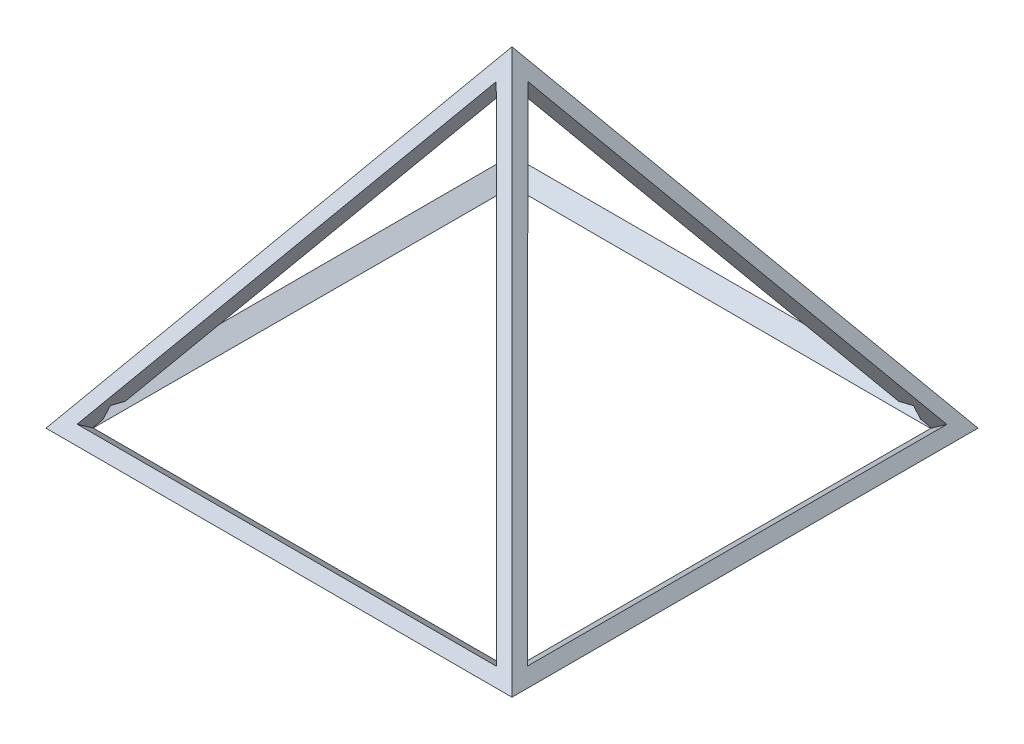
ISO-10303-21;
HEADER;
FILE_DESCRIPTION(('STEP AP214'),'2;1');
FILE_NAME('part.step','',(''),(''),'','','');
FILE_SCHEMA(('AUTOMOTIVE_DESIGN { 1 0 10303 214 1 1 1 1 }'));
ENDSEC;
DATA;
#1=APPLICATION_CONTEXT('core data for automotive mechanical design processes');
#2=APPLICATION_PROTOCOL_DEFINITION('international standard','automotive_design',2000,#1);
#3=PRODUCT_CONTEXT('',#1,'mechanical');
#4=PRODUCT('Part','Part','',(#3));
#5=PRODUCT_RELATED_PRODUCT_CATEGORY('part','',(#4));
#6=PRODUCT_DEFINITION_FORMATION('','',#4);
#7=PRODUCT_DEFINITION_CONTEXT('part definition',#1,'design');
#8=PRODUCT_DEFINITION('design','',#6,#7);
#9=PRODUCT_DEFINITION_SHAPE('','',#8);
#10=(LENGTH_UNIT() NAMED_UNIT(*) SI_UNIT(.MILLI.,.METRE.));
#11=(NAMED_UNIT(*) PLANE_ANGLE_UNIT() SI_UNIT($,.RADIAN.));
#12=(NAMED_UNIT(*) SI_UNIT($,.STERADIAN.) SOLID_ANGLE_UNIT());
#13=UNCERTAINTY_MEASURE_WITH_UNIT(LENGTH_MEASURE(1.E-05),#10,'distance_accuracy_value','');
#14=(GEOMETRIC_REPRESENTATION_CONTEXT(3) GLOBAL_UNCERTAINTY_ASSIGNED_CONTEXT((#13)) GLOBAL_UNIT_ASSIGNED_CONTEXT((#10,
#11,#12)) REPRESENTATION_CONTEXT('',''));
#15=CARTESIAN_POINT('',(0.,0.,0.));
#16=DIRECTION('',(0.,0.,1.));
#17=DIRECTION('',(1.,0.,0.));
#18=AXIS2_PLACEMENT_3D('',#15,#16,#17);
#19=CARTESIAN_POINT('',(37.6966543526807,-0.204417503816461,-37.9928324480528));
#20=DIRECTION('',(-0.287871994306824,0.408084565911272,-0.866369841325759));
#21=DIRECTION('',(0.,0.904665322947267,0.426122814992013));
#22=AXIS2_PLACEMENT_3D('',#19,#20,#21);
#23=PLANE('',#22);
#24=DIRECTION('',(0.948984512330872,0.,-0.31532268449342));
#25=VECTOR('',#24,1.);
#26=CARTESIAN_POINT('',(38.0073642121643,2.,-37.0577305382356));
#27=LINE('',#26,#25);
#28=CARTESIAN_POINT('',(36.6123738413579,2.,-36.5942117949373));
#29=VERTEX_POINT('',#28);
#30=CARTESIAN_POINT('',(37.5524536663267,2.,-36.9065756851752));
#31=VERTEX_POINT('',#30);
#32=EDGE_CURVE('E347',#29,#31,#27,.T.);
#33=ORIENTED_EDGE('',*,*,#32,.T.);
#34=DIRECTION('',(0.,-0.904665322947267,-0.426122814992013));
#35=VECTOR('',#34,1.);
#36=CARTESIAN_POINT('',(37.5524536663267,-0.22288832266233,-37.9536186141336));
#37=LINE('',#36,#35);
#38=CARTESIAN_POINT('',(37.5524536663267,0.672111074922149,-37.5320487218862));
#39=VERTEX_POINT('',#38);
#40=EDGE_CURVE('E373',#31,#39,#37,.T.);
#41=ORIENTED_EDGE('',*,*,#40,.T.);
#42=DIRECTION('',(0.500596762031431,-0.707106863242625,-0.499402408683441));
#43=VECTOR('',#42,1.);
#44=CARTESIAN_POINT('',(38.0140550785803,0.0200862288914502,-37.9925488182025));
#45=LINE('',#44,#43);
#46=CARTESIAN_POINT('',(38.0071589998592,0.0298271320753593,-37.9856691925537));
#47=VERTEX_POINT('',#46);
#48=EDGE_CURVE('E580',#39,#47,#45,.T.);
#49=ORIENTED_EDGE('',*,*,#48,.T.);
#50=DIRECTION('',(-0.956410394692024,-0.168871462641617,0.238246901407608));
#51=VECTOR('',#50,1.);
#52=CARTESIAN_POINT('',(37.6869332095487,-0.0267144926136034,-37.9058992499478));
#53=LINE('',#52,#51);
#54=CARTESIAN_POINT('',(37.8382318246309,0.,-37.9435885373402));
#55=VERTEX_POINT('',#54);
#56=EDGE_CURVE('E499',#47,#55,#53,.T.);
#57=ORIENTED_EDGE('',*,*,#56,.T.);
#58=DIRECTION('',(0.948984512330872,0.,-0.31532268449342));
#59=VECTOR('',#58,1.);
#60=CARTESIAN_POINT('',(-7.59190603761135,0.,-22.848344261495));
#61=LINE('',#60,#59);
#62=CARTESIAN_POINT('',(37.9864346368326,0.,-37.9928324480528));
#63=VERTEX_POINT('',#62);
#64=EDGE_CURVE('E496',#55,#63,#61,.T.);
#65=ORIENTED_EDGE('',*,*,#64,.T.);
#66=DIRECTION('',(0.817144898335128,0.576432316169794,0.));
#67=VECTOR('',#66,1.);
#68=CARTESIAN_POINT('',(37.6966543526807,-0.204417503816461,-37.9928324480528));
#69=LINE('',#68,#67);
#70=CARTESIAN_POINT('',(39.3309441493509,0.948447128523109,-37.9928324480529));
#71=VERTEX_POINT('',#70);
#72=EDGE_CURVE('E498',#63,#71,#69,.T.);
#73=ORIENTED_EDGE('',*,*,#72,.T.);
#74=DIRECTION('',(-0.499403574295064,0.707949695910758,0.499402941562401));
#75=VECTOR('',#74,1.);
#76=CARTESIAN_POINT('',(39.3309441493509,0.948447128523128,-37.9928324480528));
#77=LINE('',#76,#75);
#78=CARTESIAN_POINT('',(21.3524154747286,26.4346361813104,-20.0143265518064));
#79=VERTEX_POINT('',#78);
#80=EDGE_CURVE('E508',#71,#79,#77,.T.);
#81=ORIENTED_EDGE('',*,*,#80,.T.);
#82=DIRECTION('',(0.817144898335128,0.576432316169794,0.));
#83=VECTOR('',#82,1.);
#84=CARTESIAN_POINT('',(19.7181256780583,25.2817715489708,-20.0143265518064));
#85=LINE('',#84,#83);
#86=CARTESIAN_POINT('',(19.9928367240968,25.4755588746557,-20.0143265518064));
#87=VERTEX_POINT('',#86);
#88=EDGE_CURVE('E514',#87,#79,#85,.T.);
#89=ORIENTED_EDGE('',*,*,#88,.F.);
#90=CARTESIAN_POINT('',(19.9999893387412,25.465455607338,-20.0214621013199));
#91=VERTEX_POINT('',#90);
#92=EDGE_CURVE('E389',#87,#91,#45,.T.);
#93=ORIENTED_EDGE('',*,*,#92,.T.);
#94=DIRECTION('',(-0.316755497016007,-0.89432071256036,-0.31600066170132));
#95=VECTOR('',#94,1.);
#96=CARTESIAN_POINT('',(19.9218911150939,25.2449547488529,-20.0993742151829));
#97=LINE('',#96,#95);
#98=CARTESIAN_POINT('',(20.,25.4654857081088,-20.0214514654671));
#99=VERTEX_POINT('',#98);
#100=EDGE_CURVE('E500',#99,#91,#97,.T.);
#101=ORIENTED_EDGE('',*,*,#100,.F.);
#102=DIRECTION('',(-0.239730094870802,0.845154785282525,0.477747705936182));
#103=VECTOR('',#102,1.);
#104=CARTESIAN_POINT('',(24.2049253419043,10.6412610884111,-28.4012647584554));
#105=LINE('',#104,#103);
#106=CARTESIAN_POINT('',(20.0000213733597,25.4654103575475,-20.0214940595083));
#107=VERTEX_POINT('',#106);
#108=EDGE_CURVE('E503',#107,#99,#105,.T.);
#109=ORIENTED_EDGE('',*,*,#108,.F.);
#110=EDGE_CURVE('E581',#107,#29,#45,.T.);
#111=ORIENTED_EDGE('',*,*,#110,.T.);
#112=EDGE_LOOP('',(#33,#41,#49,#57,#65,#73,#81,#89,#93,#101,#109,#111));
#113=FACE_BOUND('',#112,.T.);
#114=ADVANCED_FACE('F35',(#113),#23,.F.);
#115=CARTESIAN_POINT('',(19.7181256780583,25.2817715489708,-20.0143265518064));
#116=DIRECTION('',(-0.288560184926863,0.409060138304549,0.865680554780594));
#117=DIRECTION('',(0.,-0.904141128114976,0.427233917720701));
#118=AXIS2_PLACEMENT_3D('',#115,#116,#117);
#119=PLANE('',#118);
#120=DIRECTION('',(0.499999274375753,-0.706685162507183,0.500596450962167));
#121=VECTOR('',#120,1.);
#122=CARTESIAN_POINT('',(37.9996651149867,0.0328073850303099,-1.989583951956));
#123=LINE('',#122,#121);
#124=CARTESIAN_POINT('',(37.5422490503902,0.679306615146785,-2.44754633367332));
#125=VERTEX_POINT('',#124);
#126=CARTESIAN_POINT('',(37.9964119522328,0.0374053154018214,-1.99284100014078));
#127=VERTEX_POINT('',#126);
#128=EDGE_CURVE('E423',#125,#127,#123,.T.);
#129=ORIENTED_EDGE('',*,*,#128,.F.);
#130=DIRECTION('',(0.817144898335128,0.576432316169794,0.));
#131=VECTOR('',#130,1.);
#132=CARTESIAN_POINT('',(37.2290900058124,0.458397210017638,-2.44754633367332));
#133=LINE('',#132,#131);
#134=CARTESIAN_POINT('',(37.5524536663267,0.686505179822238,-2.44754633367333));
#135=VERTEX_POINT('',#134);
#136=EDGE_CURVE('E386',#125,#135,#133,.T.);
#137=ORIENTED_EDGE('',*,*,#136,.T.);
#138=DIRECTION('',(0.,0.904141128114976,-0.427233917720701));
#139=VECTOR('',#138,1.);
#140=CARTESIAN_POINT('',(37.5524536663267,27.5781181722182,-15.1546435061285));
#141=LINE('',#140,#139);
#142=CARTESIAN_POINT('',(37.5524536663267,2.,-3.06821220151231));
#143=VERTEX_POINT('',#142);
#144=EDGE_CURVE('E376',#135,#143,#141,.T.);
#145=ORIENTED_EDGE('',*,*,#144,.T.);
#146=DIRECTION('',(-0.948683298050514,0.,-0.316227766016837));
#147=VECTOR('',#146,1.);
#148=CARTESIAN_POINT('',(16.417724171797,2.,-10.1131220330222));
#149=LINE('',#148,#147);
#150=CARTESIAN_POINT('',(36.6078219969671,2.,-3.38308942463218));
#151=VERTEX_POINT('',#150);
#152=EDGE_CURVE('E367',#143,#151,#149,.T.);
#153=ORIENTED_EDGE('',*,*,#152,.T.);
#154=CARTESIAN_POINT('',(20.0428941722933,25.4124114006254,-19.9678016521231));
#155=VERTEX_POINT('',#154);
#156=EDGE_CURVE('E419',#155,#151,#123,.T.);
#157=ORIENTED_EDGE('',*,*,#156,.F.);
#158=DIRECTION('',(0.00204085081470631,0.904401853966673,-0.426676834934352));
#159=VECTOR('',#158,1.);
#160=CARTESIAN_POINT('',(20.0426922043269,25.3229094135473,-19.9255765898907));
#161=LINE('',#160,#159);
#162=CARTESIAN_POINT('',(20.0429796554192,25.4502931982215,-19.9856734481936));
#163=VERTEX_POINT('',#162);
#164=EDGE_CURVE('E410',#155,#163,#161,.T.);
#165=ORIENTED_EDGE('',*,*,#164,.T.);
#166=DIRECTION('',(-0.948683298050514,0.,-0.316227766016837));
#167=VECTOR('',#166,1.);
#168=CARTESIAN_POINT('',(19.7420151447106,25.4502931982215,-20.0859949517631));
#169=LINE('',#168,#167);
#170=CARTESIAN_POINT('',(20.0160917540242,25.4502931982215,-19.9946360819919));
#171=VERTEX_POINT('',#170);
#172=EDGE_CURVE('E413',#163,#171,#169,.T.);
#173=ORIENTED_EDGE('',*,*,#172,.T.);
#174=CARTESIAN_POINT('',(20.,25.4730368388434,-20.0107470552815));
#175=VERTEX_POINT('',#174);
#176=EDGE_CURVE('E408',#175,#171,#123,.T.);
#177=ORIENTED_EDGE('',*,*,#176,.F.);
#178=DIRECTION('',(0.478351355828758,0.84480847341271,-0.239746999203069));
#179=VECTOR('',#178,1.);
#180=CARTESIAN_POINT('',(19.9538025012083,25.3914481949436,-19.9875931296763));
#181=LINE('',#180,#179);
#182=CARTESIAN_POINT('',(19.9957032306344,25.4654483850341,-20.0085935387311));
#183=VERTEX_POINT('',#182);
#184=EDGE_CURVE('E493',#183,#175,#181,.T.);
#185=ORIENTED_EDGE('',*,*,#184,.F.);
#186=DIRECTION('',(-0.239453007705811,0.844577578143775,-0.478906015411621));
#187=VECTOR('',#186,1.);
#188=CARTESIAN_POINT('',(20.0162763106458,25.3928848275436,-19.9674473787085));
#189=LINE('',#188,#187);
#190=EDGE_CURVE('E522',#183,#87,#189,.T.);
#191=ORIENTED_EDGE('',*,*,#190,.T.);
#192=ORIENTED_EDGE('',*,*,#88,.T.);
#193=DIRECTION('',(0.499006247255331,-0.707386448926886,0.5005968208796));
#194=VECTOR('',#193,1.);
#195=CARTESIAN_POINT('',(21.3524154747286,26.4346361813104,-20.0143265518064));
#196=LINE('',#195,#194);
#197=CARTESIAN_POINT('',(39.3166403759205,0.968724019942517,-1.99284100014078));
#198=VERTEX_POINT('',#197);
#199=EDGE_CURVE('E414',#79,#198,#196,.T.);
#200=ORIENTED_EDGE('',*,*,#199,.T.);
#201=DIRECTION('',(0.817144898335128,0.576432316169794,0.));
#202=VECTOR('',#201,1.);
#203=CARTESIAN_POINT('',(37.6823505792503,-0.184140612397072,-1.99284100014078));
#204=LINE('',#203,#202);
#205=EDGE_CURVE('E515',#127,#198,#204,.T.);
#206=ORIENTED_EDGE('',*,*,#205,.F.);
#207=EDGE_LOOP('',(#129,#137,#145,#153,#157,#165,#173,#177,#185,#191,#192,#200,#206));
#208=FACE_BOUND('',#207,.T.);
#209=ADVANCED_FACE('F684',(#208),#119,.F.);
#210=CARTESIAN_POINT('',(20.2818743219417,25.2817715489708,-19.9856734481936));
#211=DIRECTION('',(0.288560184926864,0.409060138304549,-0.865680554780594));
#212=DIRECTION('',(0.,0.904141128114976,0.427233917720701));
#213=AXIS2_PLACEMENT_3D('',#210,#211,#212);
#214=PLANE('',#213);
#215=DIRECTION('',(0.948683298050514,0.,0.316227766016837));
#216=VECTOR('',#215,1.);
#217=CARTESIAN_POINT('',(11.6078090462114,0.,-34.8234271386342));
#218=LINE('',#217,#216);
#219=CARTESIAN_POINT('',(2.05661346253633,0.,-38.0071589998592));
#220=VERTEX_POINT('',#219);
#221=CARTESIAN_POINT('',(2.11918840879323,0.,-37.9863006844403));
#222=VERTEX_POINT('',#221);
#223=EDGE_CURVE('E544',#220,#222,#218,.T.);
#224=ORIENTED_EDGE('',*,*,#223,.T.);
#225=DIRECTION('',(-0.956279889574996,0.168040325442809,-0.239355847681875));
#226=VECTOR('',#225,1.);
#227=CARTESIAN_POINT('',(18.7860084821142,-2.92874282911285,-33.8146132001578));
#228=LINE('',#227,#226);
#229=CARTESIAN_POINT('',(2.03585479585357,0.0146436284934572,-38.0071589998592));
#230=VERTEX_POINT('',#229);
#231=EDGE_CURVE('E547',#222,#230,#228,.T.);
#232=ORIENTED_EDGE('',*,*,#231,.T.);
#233=DIRECTION('',(-0.817144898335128,0.576432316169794,0.));
#234=VECTOR('',#233,1.);
#235=CARTESIAN_POINT('',(2.31764942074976,-0.184140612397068,-38.0071589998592));
#236=LINE('',#235,#234);
#237=EDGE_CURVE('E399',#220,#230,#236,.T.);
#238=ORIENTED_EDGE('',*,*,#237,.F.);
#239=EDGE_LOOP('',(#224,#232,#238));
#240=FACE_BOUND('',#239,.T.);
#241=ADVANCED_FACE('F660',(#240),#214,.F.);
#242=CARTESIAN_POINT('',(2.31764942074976,-0.184140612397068,-38.0071589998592));
#243=DIRECTION('',(-0.576432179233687,-0.817144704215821,-0.000689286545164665));
#244=DIRECTION('',(0.817144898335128,-0.576432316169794,0.));
#245=AXIS2_PLACEMENT_3D('',#242,#243,#244);
#246=PLANE('',#245);
#247=ORIENTED_EDGE('',*,*,#237,.T.);
#248=DIRECTION('',(0.631999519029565,-0.446361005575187,0.633512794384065));
#249=VECTOR('',#248,1.);
#250=CARTESIAN_POINT('',(2.20448718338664,-0.10445602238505,-37.8381228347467));
#251=LINE('',#250,#249);
#252=CARTESIAN_POINT('',(2.05658861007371,0.,-37.9863755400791));
#253=VERTEX_POINT('',#252);
#254=EDGE_CURVE('E395',#230,#253,#251,.T.);
#255=ORIENTED_EDGE('',*,*,#254,.T.);
#256=DIRECTION('',(0.0011957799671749,0.,-0.999999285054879));
#257=VECTOR('',#256,1.);
#258=CARTESIAN_POINT('',(2.01116235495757,0.,0.00240490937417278));
#259=LINE('',#258,#257);
#260=EDGE_CURVE('E398',#253,#220,#259,.T.);
#261=ORIENTED_EDGE('',*,*,#260,.T.);
#262=EDGE_LOOP('',(#247,#255,#261));
#263=FACE_BOUND('',#262,.T.);
#264=ADVANCED_FACE('F656',(#263),#246,.F.);
#265=CARTESIAN_POINT('',(1.99999999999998,-0.194281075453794,-2.31049611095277));
#266=DIRECTION('',(0.,-0.817144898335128,0.576432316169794));
#267=DIRECTION('',(0.,-0.576432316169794,-0.817144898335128));
#268=AXIS2_PLACEMENT_3D('',#265,#266,#267);
#269=PLANE('',#268);
#270=DIRECTION('',(0.,0.576432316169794,0.817144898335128));
#271=VECTOR('',#270,1.);
#272=CARTESIAN_POINT('',(1.99999999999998,-0.194281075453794,-2.31049611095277));
#273=LINE('',#272,#271);
#274=CARTESIAN_POINT('',(1.99999999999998,0.,-2.03508512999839));
#275=VERTEX_POINT('',#274);
#276=CARTESIAN_POINT('',(1.99999999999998,0.00958140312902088,-2.02150262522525));
#277=VERTEX_POINT('',#276);
#278=EDGE_CURVE('E465',#275,#277,#273,.T.);
#279=ORIENTED_EDGE('',*,*,#278,.T.);
#280=DIRECTION('',(0.633210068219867,-0.446147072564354,-0.632453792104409));
#281=VECTOR('',#280,1.);
#282=CARTESIAN_POINT('',(2.17332711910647,-0.112541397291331,-2.19462273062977));
#283=LINE('',#282,#281);
#284=CARTESIAN_POINT('',(2.01359874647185,0.,-2.03508512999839));
#285=VERTEX_POINT('',#284);
#286=EDGE_CURVE('E468',#277,#285,#283,.T.);
#287=ORIENTED_EDGE('',*,*,#286,.T.);
#288=DIRECTION('',(-1.,0.,0.));
#289=VECTOR('',#288,1.);
#290=CARTESIAN_POINT('',(0.,0.,-2.03508512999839));
#291=LINE('',#290,#289);
#292=EDGE_CURVE('E429',#285,#275,#291,.T.);
#293=ORIENTED_EDGE('',*,*,#292,.T.);
#294=EDGE_LOOP('',(#279,#287,#293));
#295=FACE_BOUND('',#294,.T.);
#296=ADVANCED_FACE('F733',(#295),#269,.F.);
#297=CARTESIAN_POINT('',(20.,25.2817755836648,-20.2818771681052));
#298=DIRECTION('',(-0.866025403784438,0.408572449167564,-0.288216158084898));
#299=DIRECTION('',(-0.426678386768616,-0.904403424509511,0.));
#300=AXIS2_PLACEMENT_3D('',#297,#298,#299);
#301=PLANE('',#300);
#302=DIRECTION('',(0.315775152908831,0.,-0.948834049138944));
#303=VECTOR('',#302,1.);
#304=CARTESIAN_POINT('',(1.19082352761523,0.,0.396310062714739));
#305=LINE('',#304,#303);
#306=CARTESIAN_POINT('',(2.01364778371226,0.,-2.07609368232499));
#307=VERTEX_POINT('',#306);
#308=EDGE_CURVE('E409',#275,#307,#305,.T.);
#309=ORIENTED_EDGE('',*,*,#308,.T.);
#310=DIRECTION('',(-0.239094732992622,0.167856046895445,0.956377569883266));
#311=VECTOR('',#310,1.);
#312=CARTESIAN_POINT('',(6.19023734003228,-2.93216752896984,-18.782428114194));
#313=LINE('',#312,#311);
#314=EDGE_CURVE('E405',#307,#277,#313,.T.);
#315=ORIENTED_EDGE('',*,*,#314,.T.);
#316=ORIENTED_EDGE('',*,*,#278,.F.);
#317=EDGE_LOOP('',(#309,#315,#316));
#318=FACE_BOUND('',#317,.T.);
#319=ADVANCED_FACE('F727',(#318),#301,.F.);
#320=CARTESIAN_POINT('',(38.,-0.194281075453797,-2.31049611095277));
#321=DIRECTION('',(0.866025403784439,0.408572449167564,-0.288216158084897));
#322=DIRECTION('',(-0.426678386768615,0.904403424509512,0.));
#323=AXIS2_PLACEMENT_3D('',#320,#321,#322);
#324=PLANE('',#323);
#325=DIRECTION('',(0.315775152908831,0.,0.948834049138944));
#326=VECTOR('',#325,1.);
#327=CARTESIAN_POINT('',(37.0680100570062,2.,-2.00032673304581));
#328=LINE('',#327,#326);
#329=CARTESIAN_POINT('',(36.9191738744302,2.,-2.44754633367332));
#330=VERTEX_POINT('',#329);
#331=EDGE_CURVE('E364',#151,#330,#328,.T.);
#332=ORIENTED_EDGE('',*,*,#331,.T.);
#333=DIRECTION('',(0.426678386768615,-0.904403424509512,0.));
#334=VECTOR('',#333,1.);
#335=CARTESIAN_POINT('',(37.9626928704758,-0.21188178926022,-2.44754633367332));
#336=LINE('',#335,#334);
#337=EDGE_CURVE('E383',#330,#125,#336,.T.);
#338=ORIENTED_EDGE('',*,*,#337,.T.);
#339=ORIENTED_EDGE('',*,*,#128,.T.);
#340=DIRECTION('',(-0.238507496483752,-0.169055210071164,-0.956312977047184));
#341=VECTOR('',#340,1.);
#342=CARTESIAN_POINT('',(37.9148209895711,-0.0204267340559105,-2.31998583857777));
#343=LINE('',#342,#341);
#344=CARTESIAN_POINT('',(37.9436395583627,0.,-2.20443571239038));
#345=VERTEX_POINT('',#344);
#346=EDGE_CURVE('E415',#127,#345,#343,.T.);
#347=ORIENTED_EDGE('',*,*,#346,.T.);
#348=DIRECTION('',(0.315775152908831,0.,0.948834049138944));
#349=VECTOR('',#348,1.);
#350=CARTESIAN_POINT('',(34.8206185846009,0.,-11.5884186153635));
#351=LINE('',#350,#349);
#352=CARTESIAN_POINT('',(38.,0.,-2.03508512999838));
#353=VERTEX_POINT('',#352);
#354=EDGE_CURVE('E418',#345,#353,#351,.T.);
#355=ORIENTED_EDGE('',*,*,#354,.T.);
#356=DIRECTION('',(0.,0.576432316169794,0.817144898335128));
#357=VECTOR('',#356,1.);
#358=CARTESIAN_POINT('',(38.,-0.194281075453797,-2.31049611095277));
#359=LINE('',#358,#357);
#360=CARTESIAN_POINT('',(38.,0.958583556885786,-0.67620631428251));
#361=VERTEX_POINT('',#360);
#362=EDGE_CURVE('E434',#353,#361,#359,.T.);
#363=ORIENTED_EDGE('',*,*,#362,.T.);
#364=DIRECTION('',(-0.5,0.707668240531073,-0.499205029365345));
#365=VECTOR('',#364,1.);
#366=CARTESIAN_POINT('',(38.,0.958583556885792,-0.676206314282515));
#367=LINE('',#366,#365);
#368=CARTESIAN_POINT('',(20.,26.4346402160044,-18.647587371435));
#369=VERTEX_POINT('',#368);
#370=EDGE_CURVE('E456',#361,#369,#367,.T.);
#371=ORIENTED_EDGE('',*,*,#370,.T.);
#372=DIRECTION('',(0.,0.576432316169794,0.817144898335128));
#373=VECTOR('',#372,1.);
#374=CARTESIAN_POINT('',(20.,25.2817755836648,-20.2818771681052));
#375=LINE('',#374,#373);
#376=EDGE_CURVE('E464',#175,#369,#375,.T.);
#377=ORIENTED_EDGE('',*,*,#376,.F.);
#378=ORIENTED_EDGE('',*,*,#176,.T.);
#379=DIRECTION('',(-0.316302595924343,0.894106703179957,0.317058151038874));
#380=VECTOR('',#379,1.);
#381=CARTESIAN_POINT('',(27.2943542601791,4.87650285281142,-27.2902842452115));
#382=LINE('',#381,#380);
#383=CARTESIAN_POINT('',(20.0071504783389,25.4755679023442,-19.9856734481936));
#384=VERTEX_POINT('',#383);
#385=EDGE_CURVE('E422',#171,#384,#382,.T.);
#386=ORIENTED_EDGE('',*,*,#385,.T.);
#387=DIRECTION('',(0.47825380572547,-0.845039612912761,0.239126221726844));
#388=VECTOR('',#387,1.);
#389=CARTESIAN_POINT('',(36.5182827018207,-3.69839917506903,-11.7301308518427));
#390=LINE('',#389,#388);
#391=EDGE_CURVE('E541',#384,#155,#390,.T.);
#392=ORIENTED_EDGE('',*,*,#391,.T.);
#393=ORIENTED_EDGE('',*,*,#156,.T.);
#394=EDGE_LOOP('',(#332,#338,#339,#347,#355,#363,#371,#377,#378,#386,#392,#393));
#395=FACE_BOUND('',#394,.T.);
#396=ADVANCED_FACE('F730',(#395),#324,.F.);
#397=CARTESIAN_POINT('',(0.,0.,0.));
#398=DIRECTION('',(-0.817144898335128,0.576432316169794,0.));
#399=DIRECTION('',(-0.576432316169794,-0.817144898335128,0.));
#400=AXIS2_PLACEMENT_3D('',#397,#398,#399);
#401=PLANE('',#400);
#402=DIRECTION('',(0.499403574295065,0.707949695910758,-0.499402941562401));
#403=VECTOR('',#402,1.);
#404=CARTESIAN_POINT('',(0.669055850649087,0.948447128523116,-2.00716755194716));
#405=LINE('',#404,#403);
#406=CARTESIAN_POINT('',(0.669055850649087,0.948447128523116,-2.00716755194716));
#407=VERTEX_POINT('',#406);
#408=CARTESIAN_POINT('',(18.6475845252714,26.4346361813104,-19.9856734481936));
#409=VERTEX_POINT('',#408);
#410=EDGE_CURVE('E526',#407,#409,#405,.T.);
#411=ORIENTED_EDGE('',*,*,#410,.F.);
#412=DIRECTION('',(-0.000397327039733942,-0.000563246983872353,0.999999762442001));
#413=VECTOR('',#412,1.);
#414=CARTESIAN_POINT('',(0.683359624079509,0.968724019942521,-38.0071589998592));
#415=LINE('',#414,#413);
#416=CARTESIAN_POINT('',(0.683359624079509,0.968724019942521,-38.0071589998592));
#417=VERTEX_POINT('',#416);
#418=EDGE_CURVE('E565',#417,#407,#415,.T.);
#419=ORIENTED_EDGE('',*,*,#418,.F.);
#420=DIRECTION('',(-0.49900624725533,-0.707386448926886,-0.5005968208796));
#421=VECTOR('',#420,1.);
#422=CARTESIAN_POINT('',(18.6475845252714,26.4346361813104,-19.9856734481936));
#423=LINE('',#422,#421);
#424=EDGE_CURVE('E533',#409,#417,#423,.T.);
#425=ORIENTED_EDGE('',*,*,#424,.F.);
#426=EDGE_LOOP('',(#411,#419,#425));
#427=FACE_BOUND('',#426,.T.);
#428=DIRECTION('',(0.,0.,1.));
#429=VECTOR('',#428,1.);
#430=CARTESIAN_POINT('',(0.,0.,0.));
#431=LINE('',#430,#429);
#432=CARTESIAN_POINT('',(0.,0.,-40.));
#433=VERTEX_POINT('',#432);
#434=CARTESIAN_POINT('',(0.,0.,0.));
#435=VERTEX_POINT('',#434);
#436=EDGE_CURVE('E444',#433,#435,#431,.T.);
#437=ORIENTED_EDGE('',*,*,#436,.T.);
#438=DIRECTION('',(-0.499403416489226,-0.707949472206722,0.499403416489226));
#439=VECTOR('',#438,1.);
#440=CARTESIAN_POINT('',(0.,0.,0.));
#441=LINE('',#440,#439);
#442=CARTESIAN_POINT('',(20.,28.351807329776,-20.));
#443=VERTEX_POINT('',#442);
#444=EDGE_CURVE('E445',#443,#435,#441,.T.);
#445=ORIENTED_EDGE('',*,*,#444,.F.);
#446=DIRECTION('',(-0.499403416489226,-0.707949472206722,-0.499403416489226));
#447=VECTOR('',#446,1.);
#448=CARTESIAN_POINT('',(9.97615089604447,14.1420954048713,-30.0238491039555));
#449=LINE('',#448,#447);
#450=EDGE_CURVE('E441',#443,#433,#449,.T.);
#451=ORIENTED_EDGE('',*,*,#450,.T.);
#452=EDGE_LOOP('',(#437,#445,#451));
#453=FACE_BOUND('',#452,.T.);
#454=ADVANCED_FACE('F734',(#427,#453),#401,.T.);
#455=CARTESIAN_POINT('',(0.,0.,0.));
#456=DIRECTION('',(0.,0.576432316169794,0.817144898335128));
#457=DIRECTION('',(0.,-0.817144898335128,0.576432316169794));
#458=AXIS2_PLACEMENT_3D('',#455,#456,#457);
#459=PLANE('',#458);
#460=ORIENTED_EDGE('',*,*,#370,.F.);
#461=DIRECTION('',(1.,0.,0.));
#462=VECTOR('',#461,1.);
#463=CARTESIAN_POINT('',(1.99999999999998,0.958583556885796,-0.676206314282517));
#464=LINE('',#463,#462);
#465=CARTESIAN_POINT('',(1.99999999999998,0.958583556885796,-0.676206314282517));
#466=VERTEX_POINT('',#465);
#467=EDGE_CURVE('E428',#466,#361,#464,.T.);
#468=ORIENTED_EDGE('',*,*,#467,.F.);
#469=DIRECTION('',(-0.5,-0.707668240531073,0.499205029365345));
#470=VECTOR('',#469,1.);
#471=CARTESIAN_POINT('',(20.,26.4346402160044,-18.647587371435));
#472=LINE('',#471,#470);
#473=EDGE_CURVE('E470',#369,#466,#472,.T.);
#474=ORIENTED_EDGE('',*,*,#473,.F.);
#475=EDGE_LOOP('',(#460,#468,#474));
#476=FACE_BOUND('',#475,.T.);
#477=DIRECTION('',(1.,0.,0.));
#478=VECTOR('',#477,1.);
#479=CARTESIAN_POINT('',(0.,0.,0.));
#480=LINE('',#479,#478);
#481=CARTESIAN_POINT('',(40.,0.,0.));
#482=VERTEX_POINT('',#481);
#483=EDGE_CURVE('E443',#435,#482,#480,.T.);
#484=ORIENTED_EDGE('',*,*,#483,.T.);
#485=DIRECTION('',(0.499403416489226,-0.707949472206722,0.499403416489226));
#486=VECTOR('',#485,1.);
#487=CARTESIAN_POINT('',(40.,0.,0.));
#488=LINE('',#487,#486);
#489=EDGE_CURVE('E435',#443,#482,#488,.T.);
#490=ORIENTED_EDGE('',*,*,#489,.F.);
#491=ORIENTED_EDGE('',*,*,#444,.T.);
#492=EDGE_LOOP('',(#484,#490,#491));
#493=FACE_BOUND('',#492,.T.);
#494=ADVANCED_FACE('F737',(#476,#493),#459,.T.);
#495=CARTESIAN_POINT('',(40.,0.,0.));
#496=DIRECTION('',(0.817144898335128,0.576432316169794,0.));
#497=DIRECTION('',(-0.576432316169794,0.817144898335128,0.));
#498=AXIS2_PLACEMENT_3D('',#495,#496,#497);
#499=PLANE('',#498);
#500=ORIENTED_EDGE('',*,*,#80,.F.);
#501=DIRECTION('',(0.000397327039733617,-0.000563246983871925,-0.999999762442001));
#502=VECTOR('',#501,1.);
#503=CARTESIAN_POINT('',(39.3166403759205,0.968724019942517,-1.99284100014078));
#504=LINE('',#503,#502);
#505=EDGE_CURVE('E517',#198,#71,#504,.T.);
#506=ORIENTED_EDGE('',*,*,#505,.F.);
#507=ORIENTED_EDGE('',*,*,#199,.F.);
#508=EDGE_LOOP('',(#500,#506,#507));
#509=FACE_BOUND('',#508,.T.);
#510=DIRECTION('',(0.,0.,-1.));
#511=VECTOR('',#510,1.);
#512=CARTESIAN_POINT('',(40.,0.,0.));
#513=LINE('',#512,#511);
#514=CARTESIAN_POINT('',(40.,0.,-40.));
#515=VERTEX_POINT('',#514);
#516=EDGE_CURVE('E438',#482,#515,#513,.T.);
#517=ORIENTED_EDGE('',*,*,#516,.T.);
#518=DIRECTION('',(0.499403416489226,-0.707949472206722,-0.499403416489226));
#519=VECTOR('',#518,1.);
#520=CARTESIAN_POINT('',(30.0238491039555,14.1420954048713,-30.0238491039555));
#521=LINE('',#520,#519);
#522=EDGE_CURVE('E439',#443,#515,#521,.T.);
#523=ORIENTED_EDGE('',*,*,#522,.F.);
#524=ORIENTED_EDGE('',*,*,#489,.T.);
#525=EDGE_LOOP('',(#517,#523,#524));
#526=FACE_BOUND('',#525,.T.);
#527=ADVANCED_FACE('F742',(#509,#526),#499,.T.);
#528=CARTESIAN_POINT('',(0.,0.,-40.));
#529=DIRECTION('',(0.,0.576432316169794,-0.817144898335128));
#530=DIRECTION('',(0.,0.817144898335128,0.576432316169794));
#531=AXIS2_PLACEMENT_3D('',#528,#529,#530);
#532=PLANE('',#531);
#533=DIRECTION('',(0.499402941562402,0.707949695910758,0.499403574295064));
#534=VECTOR('',#533,1.);
#535=CARTESIAN_POINT('',(2.00716755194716,0.948447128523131,-39.3309441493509));
#536=LINE('',#535,#534);
#537=CARTESIAN_POINT('',(2.00716755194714,0.948447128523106,-39.3309441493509));
#538=VERTEX_POINT('',#537);
#539=CARTESIAN_POINT('',(19.9856734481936,26.4346361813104,-21.3524154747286));
#540=VERTEX_POINT('',#539);
#541=EDGE_CURVE('E609',#538,#540,#536,.T.);
#542=ORIENTED_EDGE('',*,*,#541,.F.);
#543=DIRECTION('',(-0.999999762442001,-0.00056324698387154,-0.000397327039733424));
#544=VECTOR('',#543,1.);
#545=CARTESIAN_POINT('',(38.0071589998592,0.968724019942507,-39.3166403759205));
#546=LINE('',#545,#544);
#547=CARTESIAN_POINT('',(38.0071589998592,0.968724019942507,-39.3166403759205));
#548=VERTEX_POINT('',#547);
#549=EDGE_CURVE('E614',#548,#538,#546,.T.);
#550=ORIENTED_EDGE('',*,*,#549,.F.);
#551=DIRECTION('',(0.5005968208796,-0.707386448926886,-0.499006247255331));
#552=VECTOR('',#551,1.);
#553=CARTESIAN_POINT('',(19.9856734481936,26.4346361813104,-21.3524154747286));
#554=LINE('',#553,#552);
#555=EDGE_CURVE('E611',#540,#548,#554,.T.);
#556=ORIENTED_EDGE('',*,*,#555,.F.);
#557=EDGE_LOOP('',(#542,#550,#556));
#558=FACE_BOUND('',#557,.T.);
#559=DIRECTION('',(-1.,0.,0.));
#560=VECTOR('',#559,1.);
#561=CARTESIAN_POINT('',(0.,0.,-40.));
#562=LINE('',#561,#560);
#563=EDGE_CURVE('E437',#515,#433,#562,.T.);
#564=ORIENTED_EDGE('',*,*,#563,.T.);
#565=ORIENTED_EDGE('',*,*,#450,.F.);
#566=ORIENTED_EDGE('',*,*,#522,.T.);
#567=EDGE_LOOP('',(#564,#565,#566));
#568=FACE_BOUND('',#567,.T.);
#569=ADVANCED_FACE('F739',(#558,#568),#532,.T.);
#570=CARTESIAN_POINT('',(0.,0.,0.));
#571=DIRECTION('',(0.,-1.,0.));
#572=DIRECTION('',(0.,0.,-1.));
#573=AXIS2_PLACEMENT_3D('',#570,#571,#572);
#574=PLANE('',#573);
#575=DIRECTION('',(0.999999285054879,0.,0.00119577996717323));
#576=VECTOR('',#575,1.);
#577=CARTESIAN_POINT('',(0.0454262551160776,0.,-37.9887804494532));
#578=LINE('',#577,#576);
#579=EDGE_CURVE('E590',#222,#55,#578,.T.);
#580=ORIENTED_EDGE('',*,*,#579,.F.);
#581=ORIENTED_EDGE('',*,*,#223,.F.);
#582=ORIENTED_EDGE('',*,*,#260,.F.);
#583=CARTESIAN_POINT('',(2.00716755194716,0.,-37.9864346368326));
#584=VERTEX_POINT('',#583);
#585=EDGE_CURVE('E593',#584,#253,#578,.T.);
#586=ORIENTED_EDGE('',*,*,#585,.F.);
#587=DIRECTION('',(-0.31532268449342,0.,-0.948984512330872));
#588=VECTOR('',#587,1.);
#589=CARTESIAN_POINT('',(13.1745199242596,0.,-4.37754772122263));
#590=LINE('',#589,#588);
#591=CARTESIAN_POINT('',(2.05641146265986,0.,-37.8382318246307));
#592=VERTEX_POINT('',#591);
#593=EDGE_CURVE('E599',#592,#584,#590,.T.);
#594=ORIENTED_EDGE('',*,*,#593,.F.);
#595=EDGE_CURVE('E404',#307,#592,#259,.T.);
#596=ORIENTED_EDGE('',*,*,#595,.F.);
#597=ORIENTED_EDGE('',*,*,#308,.F.);
#598=ORIENTED_EDGE('',*,*,#292,.F.);
#599=CARTESIAN_POINT('',(2.01356536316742,0.,-2.00716755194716));
#600=VERTEX_POINT('',#599);
#601=EDGE_CURVE('E527',#600,#285,#259,.T.);
#602=ORIENTED_EDGE('',*,*,#601,.F.);
#603=DIRECTION('',(-0.948984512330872,0.,0.31532268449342));
#604=VECTOR('',#603,1.);
#605=CARTESIAN_POINT('',(-0.400411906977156,0.,-1.2050661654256));
#606=LINE('',#605,#604);
#607=CARTESIAN_POINT('',(2.09758516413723,0.,-2.03508512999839));
#608=VERTEX_POINT('',#607);
#609=EDGE_CURVE('E530',#608,#600,#606,.T.);
#610=ORIENTED_EDGE('',*,*,#609,.F.);
#611=CARTESIAN_POINT('',(37.8166541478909,0.,-2.03508512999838));
#612=VERTEX_POINT('',#611);
#613=EDGE_CURVE('E430',#612,#608,#291,.T.);
#614=ORIENTED_EDGE('',*,*,#613,.F.);
#615=DIRECTION('',(-0.948683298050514,0.,-0.316227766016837));
#616=VECTOR('',#615,1.);
#617=CARTESIAN_POINT('',(4.39219095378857,0.,-13.1765728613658));
#618=LINE('',#617,#616);
#619=CARTESIAN_POINT('',(37.9433865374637,0.,-1.99284100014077));
#620=VERTEX_POINT('',#619);
#621=EDGE_CURVE('E486',#620,#612,#618,.T.);
#622=ORIENTED_EDGE('',*,*,#621,.F.);
#623=DIRECTION('',(-0.00119577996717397,0.,0.999999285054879));
#624=VECTOR('',#623,1.);
#625=CARTESIAN_POINT('',(37.9409492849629,0.,0.0453690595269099));
#626=LINE('',#625,#624);
#627=CARTESIAN_POINT('',(37.943437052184,0.,-2.03508512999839));
#628=VERTEX_POINT('',#627);
#629=EDGE_CURVE('E462',#628,#620,#626,.T.);
#630=ORIENTED_EDGE('',*,*,#629,.F.);
#631=EDGE_CURVE('E424',#353,#628,#291,.T.);
#632=ORIENTED_EDGE('',*,*,#631,.F.);
#633=ORIENTED_EDGE('',*,*,#354,.F.);
#634=CARTESIAN_POINT('',(37.9863006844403,0.,-37.8808115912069));
#635=VERTEX_POINT('',#634);
#636=EDGE_CURVE('E485',#635,#345,#626,.T.);
#637=ORIENTED_EDGE('',*,*,#636,.F.);
#638=DIRECTION('',(-0.316227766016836,0.,0.948683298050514));
#639=VECTOR('',#638,1.);
#640=CARTESIAN_POINT('',(22.8234271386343,0.,7.60780904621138));
#641=LINE('',#640,#639);
#642=CARTESIAN_POINT('',(38.0071589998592,0.,-37.9433865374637));
#643=VERTEX_POINT('',#642);
#644=EDGE_CURVE('E567',#643,#635,#641,.T.);
#645=ORIENTED_EDGE('',*,*,#644,.F.);
#646=CARTESIAN_POINT('',(37.9863755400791,0.,-37.9434113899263));
#647=VERTEX_POINT('',#646);
#648=EDGE_CURVE('E594',#647,#643,#578,.T.);
#649=ORIENTED_EDGE('',*,*,#648,.F.);
#650=EDGE_CURVE('E480',#63,#647,#626,.T.);
#651=ORIENTED_EDGE('',*,*,#650,.F.);
#652=ORIENTED_EDGE('',*,*,#64,.F.);
#653=EDGE_LOOP('',(#580,#581,#582,#586,#594,#596,#597,#598,#602,#610,#614,#622,#630,#632,#633,
#637,#645,#649,#651,#652));
#654=FACE_BOUND('',#653,.T.);
#655=ORIENTED_EDGE('',*,*,#436,.F.);
#656=ORIENTED_EDGE('',*,*,#563,.F.);
#657=ORIENTED_EDGE('',*,*,#516,.F.);
#658=ORIENTED_EDGE('',*,*,#483,.F.);
#659=EDGE_LOOP('',(#655,#656,#657,#658));
#660=FACE_BOUND('',#659,.T.);
#661=ADVANCED_FACE('F37',(#654,#660),#574,.T.);
#662=ORIENTED_EDGE('',*,*,#613,.T.);
#663=DIRECTION('',(-0.95644299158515,0.168271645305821,0.238540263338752));
#664=VECTOR('',#663,1.);
#665=CARTESIAN_POINT('',(2.10241898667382,-0.000850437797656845,-2.03629070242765));
#666=LINE('',#665,#664);
#667=CARTESIAN_POINT('',(1.99999999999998,0.017168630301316,-2.01074704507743));
#668=VERTEX_POINT('',#667);
#669=EDGE_CURVE('E534',#608,#668,#666,.T.);
#670=ORIENTED_EDGE('',*,*,#669,.T.);
#671=EDGE_CURVE('E469',#668,#466,#273,.T.);
#672=ORIENTED_EDGE('',*,*,#671,.T.);
#673=ORIENTED_EDGE('',*,*,#467,.T.);
#674=ORIENTED_EDGE('',*,*,#362,.F.);
#675=ORIENTED_EDGE('',*,*,#631,.T.);
#676=DIRECTION('',(0.632302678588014,0.446574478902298,0.633059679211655));
#677=VECTOR('',#676,1.);
#678=CARTESIAN_POINT('',(23.4079087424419,-10.265963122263,-16.5880155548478));
#679=LINE('',#678,#677);
#680=CARTESIAN_POINT('',(37.9856306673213,0.0297999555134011,-1.99284100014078));
#681=VERTEX_POINT('',#680);
#682=EDGE_CURVE('E427',#628,#681,#679,.T.);
#683=ORIENTED_EDGE('',*,*,#682,.T.);
#684=DIRECTION('',(-0.956247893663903,-0.168639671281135,-0.239061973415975));
#685=VECTOR('',#684,1.);
#686=CARTESIAN_POINT('',(4.97125654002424,-5.79246981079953,-10.246434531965));
#687=LINE('',#686,#685);
#688=EDGE_CURVE('E479',#681,#612,#687,.T.);
#689=ORIENTED_EDGE('',*,*,#688,.T.);
#690=EDGE_LOOP('',(#662,#670,#672,#673,#674,#675,#683,#689));
#691=FACE_BOUND('',#690,.T.);
#692=ADVANCED_FACE('F639',(#691),#269,.F.);
#693=DIRECTION('',(0.499999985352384,0.707528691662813,-0.499402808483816));
#694=VECTOR('',#693,1.);
#695=CARTESIAN_POINT('',(20.0000433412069,25.4882636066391,-19.9892919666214));
#696=LINE('',#695,#694);
#697=CARTESIAN_POINT('',(2.44754633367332,0.650472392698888,-2.45775885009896));
#698=VERTEX_POINT('',#697);
#699=EDGE_CURVE('E537',#668,#698,#696,.T.);
#700=ORIENTED_EDGE('',*,*,#699,.T.);
#701=DIRECTION('',(0.,0.576432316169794,0.817144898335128));
#702=VECTOR('',#701,1.);
#703=CARTESIAN_POINT('',(2.44754633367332,0.439147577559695,-2.75733087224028));
#704=LINE('',#703,#702);
#705=CARTESIAN_POINT('',(2.44754633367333,0.657676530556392,-2.44754633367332));
#706=VERTEX_POINT('',#705);
#707=EDGE_CURVE('E379',#698,#706,#704,.T.);
#708=ORIENTED_EDGE('',*,*,#707,.T.);
#709=DIRECTION('',(0.426678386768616,0.904403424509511,0.));
#710=VECTOR('',#709,1.);
#711=CARTESIAN_POINT('',(15.1452272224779,27.5721545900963,-2.44754633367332));
#712=LINE('',#711,#710);
#713=CARTESIAN_POINT('',(3.08082612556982,2.,-2.44754633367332));
#714=VERTEX_POINT('',#713);
#715=EDGE_CURVE('E11',#706,#714,#712,.T.);
#716=ORIENTED_EDGE('',*,*,#715,.T.);
#717=DIRECTION('',(0.315775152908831,0.,-0.948834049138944));
#718=VECTOR('',#717,1.);
#719=CARTESIAN_POINT('',(10.1113941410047,2.,-23.5728383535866));
#720=LINE('',#719,#718);
#721=CARTESIAN_POINT('',(3.40123738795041,2.,-3.41031085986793));
#722=VERTEX_POINT('',#721);
#723=EDGE_CURVE('E361',#714,#722,#720,.T.);
#724=ORIENTED_EDGE('',*,*,#723,.T.);
#725=CARTESIAN_POINT('',(19.9964204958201,25.4831370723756,-19.9856734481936));
#726=VERTEX_POINT('',#725);
#727=EDGE_CURVE('E473',#722,#726,#696,.T.);
#728=ORIENTED_EDGE('',*,*,#727,.T.);
#729=DIRECTION('',(-0.239143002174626,-0.844693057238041,-0.47885724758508));
#730=VECTOR('',#729,1.);
#731=CARTESIAN_POINT('',(19.922029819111,25.2203767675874,-20.1346324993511));
#732=LINE('',#731,#730);
#733=CARTESIAN_POINT('',(19.9914105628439,25.4654411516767,-19.995705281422));
#734=VERTEX_POINT('',#733);
#735=EDGE_CURVE('E492',#726,#734,#732,.T.);
#736=ORIENTED_EDGE('',*,*,#735,.T.);
#737=DIRECTION('',(0.316001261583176,0.000532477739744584,-0.948758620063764));
#738=VECTOR('',#737,1.);
#739=CARTESIAN_POINT('',(20.0780342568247,25.4655871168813,-20.2557832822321));
#740=LINE('',#739,#738);
#741=EDGE_CURVE('E495',#734,#183,#740,.T.);
#742=ORIENTED_EDGE('',*,*,#741,.T.);
#743=ORIENTED_EDGE('',*,*,#184,.T.);
#744=ORIENTED_EDGE('',*,*,#376,.T.);
#745=ORIENTED_EDGE('',*,*,#473,.T.);
#746=ORIENTED_EDGE('',*,*,#671,.F.);
#747=EDGE_LOOP('',(#700,#708,#716,#724,#728,#736,#742,#743,#744,#745,#746));
#748=FACE_BOUND('',#747,.T.);
#749=ADVANCED_FACE('F634',(#748),#301,.F.);
#750=DIRECTION('',(0.0020408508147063,-0.904401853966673,-0.426676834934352));
#751=VECTOR('',#750,1.);
#752=CARTESIAN_POINT('',(20.0201017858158,-2.50421087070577,-33.2026446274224));
#753=LINE('',#752,#751);
#754=CARTESIAN_POINT('',(19.9570203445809,25.4502931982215,-20.0143265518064));
#755=VERTEX_POINT('',#754);
#756=CARTESIAN_POINT('',(19.9570547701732,25.4350375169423,-20.0215238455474));
#757=VERTEX_POINT('',#756);
#758=EDGE_CURVE('E540',#755,#757,#753,.T.);
#759=ORIENTED_EDGE('',*,*,#758,.T.);
#760=DIRECTION('',(0.477698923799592,0.84527044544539,0.239419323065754));
#761=VECTOR('',#760,1.);
#762=CARTESIAN_POINT('',(11.596958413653,10.6421585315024,-24.2115450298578));
#763=LINE('',#762,#761);
#764=CARTESIAN_POINT('',(19.9714150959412,25.4604475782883,-20.0143265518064));
#765=VERTEX_POINT('',#764);
#766=EDGE_CURVE('E513',#757,#765,#763,.T.);
#767=ORIENTED_EDGE('',*,*,#766,.T.);
#768=EDGE_CURVE('E509',#755,#765,#85,.T.);
#769=ORIENTED_EDGE('',*,*,#768,.F.);
#770=EDGE_LOOP('',(#759,#767,#769));
#771=FACE_BOUND('',#770,.T.);
#772=ADVANCED_FACE('F702',(#771),#23,.F.);
#773=ORIENTED_EDGE('',*,*,#768,.T.);
#774=DIRECTION('',(-0.315774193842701,-0.894213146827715,0.317284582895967));
#775=VECTOR('',#774,1.);
#776=CARTESIAN_POINT('',(19.8957061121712,25.2460539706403,-19.9382554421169));
#777=LINE('',#776,#775);
#778=CARTESIAN_POINT('',(19.967829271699,25.4502931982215,-20.0107235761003));
#779=VERTEX_POINT('',#778);
#780=EDGE_CURVE('E512',#765,#779,#777,.T.);
#781=ORIENTED_EDGE('',*,*,#780,.T.);
#782=EDGE_CURVE('E484',#779,#755,#169,.T.);
#783=ORIENTED_EDGE('',*,*,#782,.T.);
#784=EDGE_LOOP('',(#773,#781,#783));
#785=FACE_BOUND('',#784,.T.);
#786=ADVANCED_FACE('F704',(#785),#119,.F.);
#787=CARTESIAN_POINT('',(37.6823505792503,-0.184140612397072,-1.99284100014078));
#788=DIRECTION('',(0.576432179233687,-0.817144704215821,0.000689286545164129));
#789=DIRECTION('',(0.817144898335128,0.576432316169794,0.));
#790=AXIS2_PLACEMENT_3D('',#787,#788,#789);
#791=PLANE('',#790);
#792=ORIENTED_EDGE('',*,*,#650,.T.);
#793=DIRECTION('',(0.633512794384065,0.446361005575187,-0.631999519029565));
#794=VECTOR('',#793,1.);
#795=CARTESIAN_POINT('',(23.4184066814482,-10.2643123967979,-23.410241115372));
#796=LINE('',#795,#794);
#797=CARTESIAN_POINT('',(38.0071589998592,0.0146436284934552,-37.9641452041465));
#798=VERTEX_POINT('',#797);
#799=EDGE_CURVE('E483',#647,#798,#796,.T.);
#800=ORIENTED_EDGE('',*,*,#799,.T.);
#801=DIRECTION('',(-0.239355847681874,-0.168040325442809,0.956279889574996));
#802=VECTOR('',#801,1.);
#803=CARTESIAN_POINT('',(29.747040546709,-5.78439160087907,-4.96313336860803));
#804=LINE('',#803,#802);
#805=EDGE_CURVE('E571',#798,#635,#804,.T.);
#806=ORIENTED_EDGE('',*,*,#805,.T.);
#807=ORIENTED_EDGE('',*,*,#636,.T.);
#808=ORIENTED_EDGE('',*,*,#346,.F.);
#809=ORIENTED_EDGE('',*,*,#205,.T.);
#810=ORIENTED_EDGE('',*,*,#505,.T.);
#811=ORIENTED_EDGE('',*,*,#72,.F.);
#812=EDGE_LOOP('',(#792,#800,#806,#807,#808,#809,#810,#811));
#813=FACE_BOUND('',#812,.T.);
#814=ADVANCED_FACE('F706',(#813),#791,.F.);
#815=CARTESIAN_POINT('',(20.,25.4654556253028,-20.0214941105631));
#816=VERTEX_POINT('',#815);
#817=EDGE_CURVE('E459',#816,#99,#375,.T.);
#818=ORIENTED_EDGE('',*,*,#817,.F.);
#819=DIRECTION('',(0.426955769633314,-0.904271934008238,0.00101987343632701));
#820=VECTOR('',#819,1.);
#821=CARTESIAN_POINT('',(33.1957710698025,-2.48255743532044,-19.9899732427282));
#822=LINE('',#821,#820);
#823=EDGE_CURVE('E505',#816,#107,#822,.T.);
#824=ORIENTED_EDGE('',*,*,#823,.T.);
#825=ORIENTED_EDGE('',*,*,#108,.T.);
#826=EDGE_LOOP('',(#818,#824,#825));
#827=FACE_BOUND('',#826,.T.);
#828=ADVANCED_FACE('F677',(#827),#324,.F.);
#829=ORIENTED_EDGE('',*,*,#100,.T.);
#830=DIRECTION('',(0.316001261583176,0.000532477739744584,-0.948758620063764));
#831=VECTOR('',#830,1.);
#832=CARTESIAN_POINT('',(20.0780342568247,25.4655871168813,-20.2557832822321));
#833=LINE('',#832,#831);
#834=EDGE_CURVE('E463',#91,#816,#833,.T.);
#835=ORIENTED_EDGE('',*,*,#834,.T.);
#836=ORIENTED_EDGE('',*,*,#817,.T.);
#837=EDGE_LOOP('',(#829,#835,#836));
#838=FACE_BOUND('',#837,.T.);
#839=ADVANCED_FACE('F679',(#838),#301,.F.);
#840=ORIENTED_EDGE('',*,*,#629,.T.);
#841=EDGE_CURVE('E489',#620,#681,#204,.T.);
#842=ORIENTED_EDGE('',*,*,#841,.T.);
#843=ORIENTED_EDGE('',*,*,#682,.F.);
#844=EDGE_LOOP('',(#840,#842,#843));
#845=FACE_BOUND('',#844,.T.);
#846=ADVANCED_FACE('F715',(#845),#791,.F.);
#847=ORIENTED_EDGE('',*,*,#621,.T.);
#848=ORIENTED_EDGE('',*,*,#688,.F.);
#849=ORIENTED_EDGE('',*,*,#841,.F.);
#850=EDGE_LOOP('',(#847,#848,#849));
#851=FACE_BOUND('',#850,.T.);
#852=ADVANCED_FACE('F708',(#851),#119,.F.);
#853=DIRECTION('',(0.499402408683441,0.707106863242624,0.500596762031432));
#854=VECTOR('',#853,1.);
#855=CARTESIAN_POINT('',(19.9929052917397,25.4857984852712,-19.9855875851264));
#856=LINE('',#855,#854);
#857=CARTESIAN_POINT('',(2.01433080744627,0.0298271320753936,-38.0071589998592));
#858=VERTEX_POINT('',#857);
#859=CARTESIAN_POINT('',(2.46795127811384,0.672111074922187,-37.5524536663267));
#860=VERTEX_POINT('',#859);
#861=EDGE_CURVE('E604',#858,#860,#856,.T.);
#862=ORIENTED_EDGE('',*,*,#861,.T.);
#863=DIRECTION('',(-0.817144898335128,0.576432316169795,0.));
#864=VECTOR('',#863,1.);
#865=CARTESIAN_POINT('',(2.77090999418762,0.458397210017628,-37.5524536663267));
#866=LINE('',#865,#864);
#867=CARTESIAN_POINT('',(2.44754633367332,0.686505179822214,-37.5524536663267));
#868=VERTEX_POINT('',#867);
#869=EDGE_CURVE('E371',#860,#868,#866,.T.);
#870=ORIENTED_EDGE('',*,*,#869,.T.);
#871=DIRECTION('',(0.,0.904141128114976,0.427233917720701));
#872=VECTOR('',#871,1.);
#873=CARTESIAN_POINT('',(2.44754633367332,27.5781181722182,-24.8453564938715));
#874=LINE('',#873,#872);
#875=CARTESIAN_POINT('',(2.44754633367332,2.,-36.9317877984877));
#876=VERTEX_POINT('',#875);
#877=EDGE_CURVE('E326',#868,#876,#874,.T.);
#878=ORIENTED_EDGE('',*,*,#877,.T.);
#879=DIRECTION('',(0.948683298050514,0.,0.316227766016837));
#880=VECTOR('',#879,1.);
#881=CARTESIAN_POINT('',(23.5822758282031,2.,-29.8868779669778));
#882=LINE('',#881,#880);
#883=CARTESIAN_POINT('',(3.40578820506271,1.99999999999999,-36.6123738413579));
#884=VERTEX_POINT('',#883);
#885=EDGE_CURVE('E319',#876,#884,#882,.T.);
#886=ORIENTED_EDGE('',*,*,#885,.T.);
#887=EDGE_CURVE('E488',#884,#757,#856,.T.);
#888=ORIENTED_EDGE('',*,*,#887,.T.);
#889=ORIENTED_EDGE('',*,*,#758,.F.);
#890=ORIENTED_EDGE('',*,*,#782,.F.);
#891=CARTESIAN_POINT('',(19.9856734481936,25.4755588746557,-19.9928367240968));
#892=VERTEX_POINT('',#891);
#893=EDGE_CURVE('E394',#779,#892,#856,.T.);
#894=ORIENTED_EDGE('',*,*,#893,.T.);
#895=DIRECTION('',(0.478906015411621,-0.844577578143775,-0.239453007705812));
#896=VECTOR('',#895,1.);
#897=CARTESIAN_POINT('',(20.1311677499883,25.2189715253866,-20.0655838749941));
#898=LINE('',#897,#896);
#899=EDGE_CURVE('E390',#892,#734,#898,.T.);
#900=ORIENTED_EDGE('',*,*,#899,.T.);
#901=ORIENTED_EDGE('',*,*,#735,.F.);
#902=DIRECTION('',(-0.817144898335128,0.576432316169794,0.));
#903=VECTOR('',#902,1.);
#904=CARTESIAN_POINT('',(20.2818743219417,25.2817715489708,-19.9856734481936));
#905=LINE('',#904,#903);
#906=EDGE_CURVE('E393',#726,#409,#905,.T.);
#907=ORIENTED_EDGE('',*,*,#906,.T.);
#908=ORIENTED_EDGE('',*,*,#424,.T.);
#909=EDGE_CURVE('E403',#858,#417,#236,.T.);
#910=ORIENTED_EDGE('',*,*,#909,.F.);
#911=EDGE_LOOP('',(#862,#870,#878,#886,#888,#889,#890,#894,#900,#901,#907,#908,#910));
#912=FACE_BOUND('',#911,.T.);
#913=ADVANCED_FACE('F692',(#912),#214,.F.);
#914=CARTESIAN_POINT('',(2.30334564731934,-0.204417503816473,-2.00716755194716));
#915=DIRECTION('',(0.287871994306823,0.408084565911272,0.866369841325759));
#916=DIRECTION('',(0.,-0.904665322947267,0.426122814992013));
#917=AXIS2_PLACEMENT_3D('',#914,#915,#916);
#918=PLANE('',#917);
#919=DIRECTION('',(-0.948984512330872,0.,0.31532268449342));
#920=VECTOR('',#919,1.);
#921=CARTESIAN_POINT('',(1.99263578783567,2.,-2.94226946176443));
#922=LINE('',#921,#920);
#923=CARTESIAN_POINT('',(2.44754633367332,2.,-3.09342431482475));
#924=VERTEX_POINT('',#923);
#925=EDGE_CURVE('E358',#722,#924,#922,.T.);
#926=ORIENTED_EDGE('',*,*,#925,.T.);
#927=DIRECTION('',(0.,-0.904665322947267,0.426122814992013));
#928=VECTOR('',#927,1.);
#929=CARTESIAN_POINT('',(2.44754633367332,-0.222888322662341,-2.04638138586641));
#930=LINE('',#929,#928);
#931=EDGE_CURVE('E43',#924,#698,#930,.T.);
#932=ORIENTED_EDGE('',*,*,#931,.T.);
#933=ORIENTED_EDGE('',*,*,#699,.F.);
#934=ORIENTED_EDGE('',*,*,#669,.F.);
#935=ORIENTED_EDGE('',*,*,#609,.T.);
#936=DIRECTION('',(-0.817144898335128,0.576432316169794,0.));
#937=VECTOR('',#936,1.);
#938=CARTESIAN_POINT('',(2.30334564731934,-0.204417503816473,-2.00716755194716));
#939=LINE('',#938,#937);
#940=EDGE_CURVE('E532',#600,#407,#939,.T.);
#941=ORIENTED_EDGE('',*,*,#940,.T.);
#942=ORIENTED_EDGE('',*,*,#410,.T.);
#943=ORIENTED_EDGE('',*,*,#906,.F.);
#944=ORIENTED_EDGE('',*,*,#727,.F.);
#945=EDGE_LOOP('',(#926,#932,#933,#934,#935,#941,#942,#943,#944));
#946=FACE_BOUND('',#945,.T.);
#947=ADVANCED_FACE('F629',(#946),#918,.F.);
#948=ORIENTED_EDGE('',*,*,#595,.T.);
#949=DIRECTION('',(-0.238246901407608,0.168871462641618,-0.956410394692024));
#950=VECTOR('',#949,1.);
#951=CARTESIAN_POINT('',(2.04015623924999,0.0115218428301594,-37.9034862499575));
#952=LINE('',#951,#950);
#953=EDGE_CURVE('E400',#592,#858,#952,.T.);
#954=ORIENTED_EDGE('',*,*,#953,.T.);
#955=ORIENTED_EDGE('',*,*,#909,.T.);
#956=ORIENTED_EDGE('',*,*,#418,.T.);
#957=ORIENTED_EDGE('',*,*,#940,.F.);
#958=ORIENTED_EDGE('',*,*,#601,.T.);
#959=ORIENTED_EDGE('',*,*,#286,.F.);
#960=ORIENTED_EDGE('',*,*,#314,.F.);
#961=EDGE_LOOP('',(#948,#954,#955,#956,#957,#958,#959,#960));
#962=FACE_BOUND('',#961,.T.);
#963=ADVANCED_FACE('F833',(#962),#246,.F.);
#964=EDGE_CURVE('E558',#163,#384,#905,.T.);
#965=ORIENTED_EDGE('',*,*,#964,.F.);
#966=ORIENTED_EDGE('',*,*,#164,.F.);
#967=ORIENTED_EDGE('',*,*,#391,.F.);
#968=EDGE_LOOP('',(#965,#966,#967));
#969=FACE_BOUND('',#968,.T.);
#970=ADVANCED_FACE('F835',(#969),#918,.F.);
#971=ORIENTED_EDGE('',*,*,#172,.F.);
#972=ORIENTED_EDGE('',*,*,#964,.T.);
#973=ORIENTED_EDGE('',*,*,#385,.F.);
#974=EDGE_LOOP('',(#971,#972,#973));
#975=FACE_BOUND('',#974,.T.);
#976=ADVANCED_FACE('F822',(#975),#214,.F.);
#977=CARTESIAN_POINT('',(2.00716755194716,-0.204417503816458,-37.6966543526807));
#978=DIRECTION('',(-0.866369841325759,0.408084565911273,0.287871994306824));
#979=DIRECTION('',(-0.426122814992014,-0.904665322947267,0.));
#980=AXIS2_PLACEMENT_3D('',#977,#978,#979);
#981=PLANE('',#980);
#982=DIRECTION('',(-0.31532268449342,0.,-0.948984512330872));
#983=VECTOR('',#982,1.);
#984=CARTESIAN_POINT('',(2.94226946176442,2.,-38.0073642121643));
#985=LINE('',#984,#983);
#986=CARTESIAN_POINT('',(3.09342431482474,2.,-37.5524536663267));
#987=VERTEX_POINT('',#986);
#988=EDGE_CURVE('E355',#884,#987,#985,.T.);
#989=ORIENTED_EDGE('',*,*,#988,.T.);
#990=DIRECTION('',(-0.426122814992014,-0.904665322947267,0.));
#991=VECTOR('',#990,1.);
#992=CARTESIAN_POINT('',(2.0463813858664,-0.222888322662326,-37.5524536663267));
#993=LINE('',#992,#991);
#994=EDGE_CURVE('E333',#987,#860,#993,.T.);
#995=ORIENTED_EDGE('',*,*,#994,.T.);
#996=ORIENTED_EDGE('',*,*,#861,.F.);
#997=ORIENTED_EDGE('',*,*,#953,.F.);
#998=ORIENTED_EDGE('',*,*,#593,.T.);
#999=DIRECTION('',(0.,0.576432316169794,-0.817144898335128));
#1000=VECTOR('',#999,1.);
#1001=CARTESIAN_POINT('',(2.00716755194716,-0.204417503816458,-37.6966543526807));
#1002=LINE('',#1001,#1000);
#1003=EDGE_CURVE('E601',#584,#538,#1002,.T.);
#1004=ORIENTED_EDGE('',*,*,#1003,.T.);
#1005=ORIENTED_EDGE('',*,*,#541,.T.);
#1006=DIRECTION('',(0.,0.576432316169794,-0.817144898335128));
#1007=VECTOR('',#1006,1.);
#1008=CARTESIAN_POINT('',(19.9856734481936,25.2817715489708,-19.7181256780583));
#1009=LINE('',#1008,#1007);
#1010=EDGE_CURVE('E592',#892,#540,#1009,.T.);
#1011=ORIENTED_EDGE('',*,*,#1010,.F.);
#1012=ORIENTED_EDGE('',*,*,#893,.F.);
#1013=ORIENTED_EDGE('',*,*,#780,.F.);
#1014=ORIENTED_EDGE('',*,*,#766,.F.);
#1015=ORIENTED_EDGE('',*,*,#887,.F.);
#1016=EDGE_LOOP('',(#989,#995,#996,#997,#998,#1004,#1005,#1011,#1012,#1013,#1014,#1015));
#1017=FACE_BOUND('',#1016,.T.);
#1018=ADVANCED_FACE('F700',(#1017),#981,.F.);
#1019=CARTESIAN_POINT('',(38.0071589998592,-0.184140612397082,-37.6823505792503));
#1020=DIRECTION('',(0.000689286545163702,-0.817144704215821,-0.576432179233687));
#1021=DIRECTION('',(0.,0.576432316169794,-0.817144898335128));
#1022=AXIS2_PLACEMENT_3D('',#1019,#1020,#1021);
#1023=PLANE('',#1022);
#1024=DIRECTION('',(0.,0.576432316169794,-0.817144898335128));
#1025=VECTOR('',#1024,1.);
#1026=CARTESIAN_POINT('',(38.0071589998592,-0.184140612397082,-37.6823505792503));
#1027=LINE('',#1026,#1025);
#1028=EDGE_CURVE('E612',#47,#548,#1027,.T.);
#1029=ORIENTED_EDGE('',*,*,#1028,.T.);
#1030=ORIENTED_EDGE('',*,*,#549,.T.);
#1031=ORIENTED_EDGE('',*,*,#1003,.F.);
#1032=ORIENTED_EDGE('',*,*,#585,.T.);
#1033=ORIENTED_EDGE('',*,*,#254,.F.);
#1034=ORIENTED_EDGE('',*,*,#231,.F.);
#1035=ORIENTED_EDGE('',*,*,#579,.T.);
#1036=ORIENTED_EDGE('',*,*,#56,.F.);
#1037=EDGE_LOOP('',(#1029,#1030,#1031,#1032,#1033,#1034,#1035,#1036));
#1038=FACE_BOUND('',#1037,.T.);
#1039=ADVANCED_FACE('F665',(#1038),#1023,.F.);
#1040=CARTESIAN_POINT('',(19.9856734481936,25.2817715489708,-19.7181256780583));
#1041=DIRECTION('',(0.865680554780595,0.409060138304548,0.288560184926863));
#1042=DIRECTION('',(-0.4272339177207,0.904141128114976,0.));
#1043=AXIS2_PLACEMENT_3D('',#1040,#1041,#1042);
#1044=PLANE('',#1043);
#1045=ORIENTED_EDGE('',*,*,#48,.F.);
#1046=DIRECTION('',(0.,0.576432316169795,-0.817144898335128));
#1047=VECTOR('',#1046,1.);
#1048=CARTESIAN_POINT('',(37.5524536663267,0.458397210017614,-37.2290900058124));
#1049=LINE('',#1048,#1047);
#1050=CARTESIAN_POINT('',(37.5524536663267,0.686505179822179,-37.5524536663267));
#1051=VERTEX_POINT('',#1050);
#1052=EDGE_CURVE('E625',#39,#1051,#1049,.T.);
#1053=ORIENTED_EDGE('',*,*,#1052,.T.);
#1054=DIRECTION('',(-0.4272339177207,0.904141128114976,0.));
#1055=VECTOR('',#1054,1.);
#1056=CARTESIAN_POINT('',(24.8453564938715,27.5781181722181,-37.5524536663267));
#1057=LINE('',#1056,#1055);
#1058=CARTESIAN_POINT('',(36.9317877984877,2.,-37.5524536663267));
#1059=VERTEX_POINT('',#1058);
#1060=EDGE_CURVE('E622',#1051,#1059,#1057,.T.);
#1061=ORIENTED_EDGE('',*,*,#1060,.T.);
#1062=DIRECTION('',(-0.316227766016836,0.,0.948683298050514));
#1063=VECTOR('',#1062,1.);
#1064=CARTESIAN_POINT('',(29.8868779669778,2.,-16.417724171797));
#1065=LINE('',#1064,#1063);
#1066=EDGE_CURVE('E569',#1059,#29,#1065,.T.);
#1067=ORIENTED_EDGE('',*,*,#1066,.T.);
#1068=ORIENTED_EDGE('',*,*,#110,.F.);
#1069=ORIENTED_EDGE('',*,*,#823,.F.);
#1070=ORIENTED_EDGE('',*,*,#834,.F.);
#1071=ORIENTED_EDGE('',*,*,#92,.F.);
#1072=ORIENTED_EDGE('',*,*,#190,.F.);
#1073=ORIENTED_EDGE('',*,*,#741,.F.);
#1074=ORIENTED_EDGE('',*,*,#899,.F.);
#1075=ORIENTED_EDGE('',*,*,#1010,.T.);
#1076=ORIENTED_EDGE('',*,*,#555,.T.);
#1077=ORIENTED_EDGE('',*,*,#1028,.F.);
#1078=EDGE_LOOP('',(#1045,#1053,#1061,#1067,#1068,#1069,#1070,#1071,#1072,#1073,#1074,#1075,
#1076,#1077));
#1079=FACE_BOUND('',#1078,.T.);
#1080=ADVANCED_FACE('F674',(#1079),#1044,.F.);
#1081=ORIENTED_EDGE('',*,*,#648,.T.);
#1082=EDGE_CURVE('E570',#643,#798,#1027,.T.);
#1083=ORIENTED_EDGE('',*,*,#1082,.T.);
#1084=ORIENTED_EDGE('',*,*,#799,.F.);
#1085=EDGE_LOOP('',(#1081,#1083,#1084));
#1086=FACE_BOUND('',#1085,.T.);
#1087=ADVANCED_FACE('F781',(#1086),#1023,.F.);
#1088=ORIENTED_EDGE('',*,*,#644,.T.);
#1089=ORIENTED_EDGE('',*,*,#805,.F.);
#1090=ORIENTED_EDGE('',*,*,#1082,.F.);
#1091=EDGE_LOOP('',(#1088,#1089,#1090));
#1092=FACE_BOUND('',#1091,.T.);
#1093=ADVANCED_FACE('F774',(#1092),#1044,.F.);
#1094=CARTESIAN_POINT('',(0.,2.,0.));
#1095=DIRECTION('',(0.,1.,0.));
#1096=DIRECTION('',(0.,0.,1.));
#1097=AXIS2_PLACEMENT_3D('',#1094,#1095,#1096);
#1098=PLANE('',#1097);
#1099=ORIENTED_EDGE('',*,*,#1066,.F.);
#1100=DIRECTION('',(1.,0.,0.));
#1101=VECTOR('',#1100,1.);
#1102=CARTESIAN_POINT('',(2.44754633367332,2.,-37.5524536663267));
#1103=LINE('',#1102,#1101);
#1104=CARTESIAN_POINT('',(37.5524536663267,2.,-37.5524536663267));
#1105=VERTEX_POINT('',#1104);
#1106=EDGE_CURVE('E336',#1059,#1105,#1103,.T.);
#1107=ORIENTED_EDGE('',*,*,#1106,.T.);
#1108=DIRECTION('',(0.,0.,1.));
#1109=VECTOR('',#1108,1.);
#1110=CARTESIAN_POINT('',(37.5524536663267,2.,-37.5524536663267));
#1111=LINE('',#1110,#1109);
#1112=EDGE_CURVE('E338',#1105,#31,#1111,.T.);
#1113=ORIENTED_EDGE('',*,*,#1112,.T.);
#1114=ORIENTED_EDGE('',*,*,#32,.F.);
#1115=EDGE_LOOP('',(#1099,#1107,#1113,#1114));
#1116=FACE_BOUND('',#1115,.T.);
#1117=ADVANCED_FACE('F769',(#1116),#1098,.F.);
#1118=CARTESIAN_POINT('',(2.44754633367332,2.,-37.5524536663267));
#1119=DIRECTION('',(0.,0.,-1.));
#1120=DIRECTION('',(-1.,0.,0.));
#1121=AXIS2_PLACEMENT_3D('',#1118,#1119,#1120);
#1122=PLANE('',#1121);
#1123=DIRECTION('',(0.,-1.,0.));
#1124=VECTOR('',#1123,1.);
#1125=CARTESIAN_POINT('',(37.5524536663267,2.,-37.5524536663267));
#1126=LINE('',#1125,#1124);
#1127=EDGE_CURVE('E329',#1105,#1051,#1126,.T.);
#1128=ORIENTED_EDGE('',*,*,#1127,.F.);
#1129=ORIENTED_EDGE('',*,*,#1106,.F.);
#1130=ORIENTED_EDGE('',*,*,#1060,.F.);
#1131=EDGE_LOOP('',(#1128,#1129,#1130));
#1132=FACE_BOUND('',#1131,.T.);
#1133=ADVANCED_FACE('F756',(#1132),#1122,.F.);
#1134=CARTESIAN_POINT('',(37.5524536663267,2.,-37.5524536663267));
#1135=DIRECTION('',(1.,0.,0.));
#1136=DIRECTION('',(0.,0.,-1.));
#1137=AXIS2_PLACEMENT_3D('',#1134,#1135,#1136);
#1138=PLANE('',#1137);
#1139=ORIENTED_EDGE('',*,*,#1112,.F.);
#1140=ORIENTED_EDGE('',*,*,#1127,.T.);
#1141=ORIENTED_EDGE('',*,*,#1052,.F.);
#1142=ORIENTED_EDGE('',*,*,#40,.F.);
#1143=EDGE_LOOP('',(#1139,#1140,#1141,#1142));
#1144=FACE_BOUND('',#1143,.T.);
#1145=ADVANCED_FACE('F763',(#1144),#1138,.F.);
#1146=DIRECTION('',(0.,0.,-1.));
#1147=VECTOR('',#1146,1.);
#1148=CARTESIAN_POINT('',(2.44754633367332,2.,-37.5524536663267));
#1149=LINE('',#1148,#1147);
#1150=CARTESIAN_POINT('',(2.44754633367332,2.,-37.5524536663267));
#1151=VERTEX_POINT('',#1150);
#1152=EDGE_CURVE('E312',#876,#1151,#1149,.T.);
#1153=ORIENTED_EDGE('',*,*,#1152,.T.);
#1154=EDGE_CURVE('E316',#1151,#987,#1103,.T.);
#1155=ORIENTED_EDGE('',*,*,#1154,.T.);
#1156=ORIENTED_EDGE('',*,*,#988,.F.);
#1157=ORIENTED_EDGE('',*,*,#885,.F.);
#1158=EDGE_LOOP('',(#1153,#1155,#1156,#1157));
#1159=FACE_BOUND('',#1158,.T.);
#1160=ADVANCED_FACE('F314',(#1159),#1098,.F.);
#1161=ORIENTED_EDGE('',*,*,#994,.F.);
#1162=ORIENTED_EDGE('',*,*,#1154,.F.);
#1163=DIRECTION('',(0.,-1.,0.));
#1164=VECTOR('',#1163,1.);
#1165=CARTESIAN_POINT('',(2.44754633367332,2.,-37.5524536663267));
#1166=LINE('',#1165,#1164);
#1167=EDGE_CURVE('E324',#1151,#868,#1166,.T.);
#1168=ORIENTED_EDGE('',*,*,#1167,.T.);
#1169=ORIENTED_EDGE('',*,*,#869,.F.);
#1170=EDGE_LOOP('',(#1161,#1162,#1168,#1169));
#1171=FACE_BOUND('',#1170,.T.);
#1172=ADVANCED_FACE('F331',(#1171),#1122,.F.);
#1173=CARTESIAN_POINT('',(2.44754633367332,2.,-37.5524536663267));
#1174=DIRECTION('',(-1.,0.,0.));
#1175=DIRECTION('',(0.,0.,1.));
#1176=AXIS2_PLACEMENT_3D('',#1173,#1174,#1175);
#1177=PLANE('',#1176);
#1178=ORIENTED_EDGE('',*,*,#1167,.F.);
#1179=ORIENTED_EDGE('',*,*,#1152,.F.);
#1180=ORIENTED_EDGE('',*,*,#877,.F.);
#1181=EDGE_LOOP('',(#1178,#1179,#1180));
#1182=FACE_BOUND('',#1181,.T.);
#1183=ADVANCED_FACE('F325',(#1182),#1177,.F.);
#1184=DIRECTION('',(-1.,0.,0.));
#1185=VECTOR('',#1184,1.);
#1186=CARTESIAN_POINT('',(2.44754633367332,2.,-2.44754633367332));
#1187=LINE('',#1186,#1185);
#1188=CARTESIAN_POINT('',(2.44754633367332,2.,-2.44754633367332));
#1189=VERTEX_POINT('',#1188);
#1190=EDGE_CURVE('E342',#714,#1189,#1187,.T.);
#1191=ORIENTED_EDGE('',*,*,#1190,.T.);
#1192=EDGE_CURVE('E58',#1189,#924,#1149,.T.);
#1193=ORIENTED_EDGE('',*,*,#1192,.T.);
#1194=ORIENTED_EDGE('',*,*,#925,.F.);
#1195=ORIENTED_EDGE('',*,*,#723,.F.);
#1196=EDGE_LOOP('',(#1191,#1193,#1194,#1195));
#1197=FACE_BOUND('',#1196,.T.);
#1198=ADVANCED_FACE('F752',(#1197),#1098,.F.);
#1199=ORIENTED_EDGE('',*,*,#931,.F.);
#1200=ORIENTED_EDGE('',*,*,#1192,.F.);
#1201=DIRECTION('',(0.,-1.,0.));
#1202=VECTOR('',#1201,1.);
#1203=CARTESIAN_POINT('',(2.44754633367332,2.,-2.44754633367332));
#1204=LINE('',#1203,#1202);
#1205=EDGE_CURVE('E344',#1189,#706,#1204,.T.);
#1206=ORIENTED_EDGE('',*,*,#1205,.T.);
#1207=ORIENTED_EDGE('',*,*,#707,.F.);
#1208=EDGE_LOOP('',(#1199,#1200,#1206,#1207));
#1209=FACE_BOUND('',#1208,.T.);
#1210=ADVANCED_FACE('F753',(#1209),#1177,.F.);
#1211=CARTESIAN_POINT('',(2.44754633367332,2.,-2.44754633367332));
#1212=DIRECTION('',(0.,0.,1.));
#1213=DIRECTION('',(1.,0.,0.));
#1214=AXIS2_PLACEMENT_3D('',#1211,#1212,#1213);
#1215=PLANE('',#1214);
#1216=ORIENTED_EDGE('',*,*,#1205,.F.);
#1217=ORIENTED_EDGE('',*,*,#1190,.F.);
#1218=ORIENTED_EDGE('',*,*,#715,.F.);
#1219=EDGE_LOOP('',(#1216,#1217,#1218));
#1220=FACE_BOUND('',#1219,.T.);
#1221=ADVANCED_FACE('F766',(#1220),#1215,.F.);
#1222=ORIENTED_EDGE('',*,*,#337,.F.);
#1223=CARTESIAN_POINT('',(37.5524536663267,2.,-2.44754633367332));
#1224=VERTEX_POINT('',#1223);
#1225=EDGE_CURVE('E50',#1224,#330,#1187,.T.);
#1226=ORIENTED_EDGE('',*,*,#1225,.F.);
#1227=DIRECTION('',(0.,-1.,0.));
#1228=VECTOR('',#1227,1.);
#1229=CARTESIAN_POINT('',(37.5524536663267,2.,-2.44754633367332));
#1230=LINE('',#1229,#1228);
#1231=EDGE_CURVE('E348',#1224,#135,#1230,.T.);
#1232=ORIENTED_EDGE('',*,*,#1231,.T.);
#1233=ORIENTED_EDGE('',*,*,#136,.F.);
#1234=EDGE_LOOP('',(#1222,#1226,#1232,#1233));
#1235=FACE_BOUND('',#1234,.T.);
#1236=ADVANCED_FACE('F761',(#1235),#1215,.F.);
#1237=ORIENTED_EDGE('',*,*,#1231,.F.);
#1238=EDGE_CURVE('E335',#143,#1224,#1111,.T.);
#1239=ORIENTED_EDGE('',*,*,#1238,.F.);
#1240=ORIENTED_EDGE('',*,*,#144,.F.);
#1241=EDGE_LOOP('',(#1237,#1239,#1240));
#1242=FACE_BOUND('',#1241,.T.);
#1243=ADVANCED_FACE('F757',(#1242),#1138,.F.);
#1244=ORIENTED_EDGE('',*,*,#1238,.T.);
#1245=ORIENTED_EDGE('',*,*,#1225,.T.);
#1246=ORIENTED_EDGE('',*,*,#331,.F.);
#1247=ORIENTED_EDGE('',*,*,#152,.F.);
#1248=EDGE_LOOP('',(#1244,#1245,#1246,#1247));
#1249=FACE_BOUND('',#1248,.T.);
#1250=ADVANCED_FACE('F760',(#1249),#1098,.F.);
#1251=CLOSED_SHELL('',(#114,#209,#241,#264,#296,#319,#396,#454,#494,#527,#569,#661,#692,#749,
#772,#786,#814,#828,#839,#846,#852,#913,#947,#963,#970,#976,#1018,#1039,#1080,#1087,#1093,#1117,
#1133,#1145,#1160,#1172,#1183,#1198,#1210,#1221,#1236,#1243,#1250));
#1252=MANIFOLD_SOLID_BREP('B2',#1251);
#1253=ADVANCED_BREP_SHAPE_REPRESENTATION('',(#18,#1252),#14);
#1254=SHAPE_DEFINITION_REPRESENTATION(#9,#1253);
ENDSEC;
END-ISO-10303-21;
